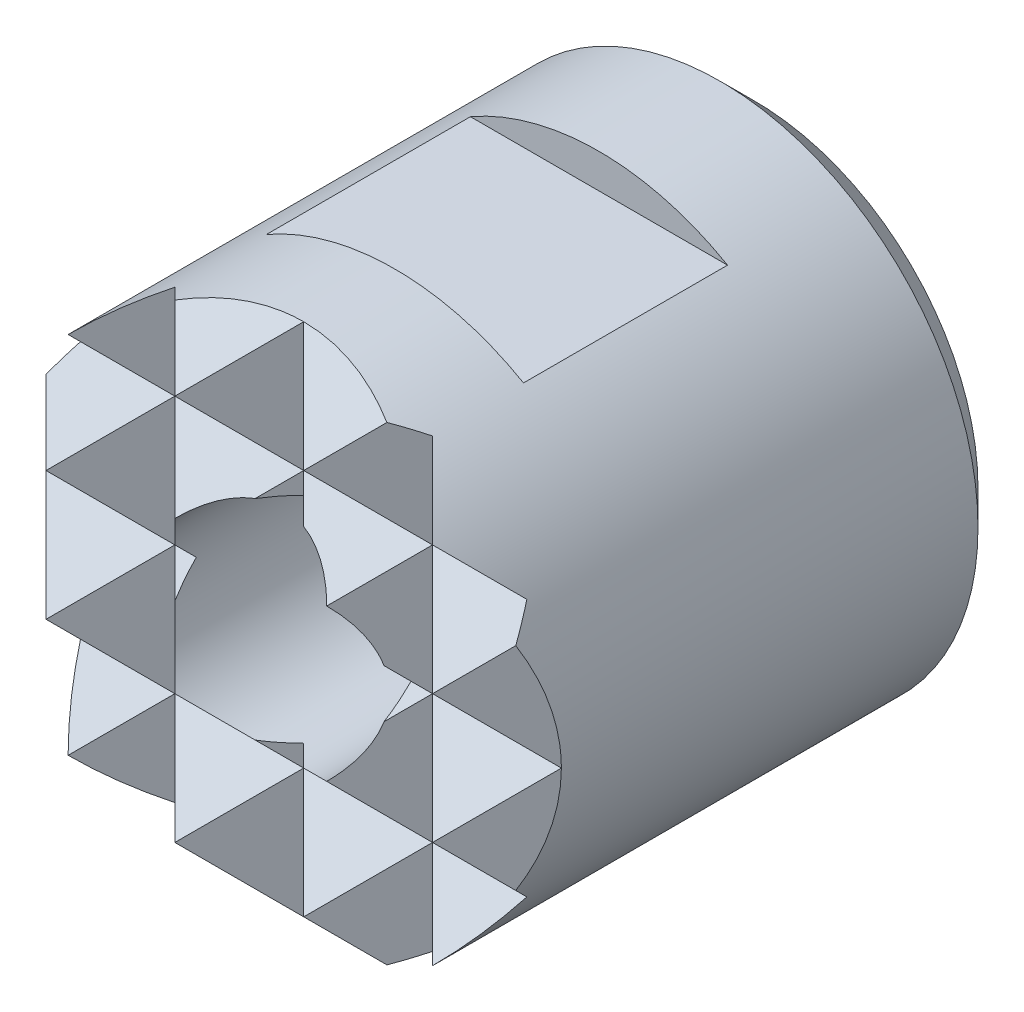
ISO-10303-21;
HEADER;
FILE_DESCRIPTION(('STEP AP214'),'2;1');
FILE_NAME('part.step','',(''),(''),'','','');
FILE_SCHEMA(('AUTOMOTIVE_DESIGN { 1 0 10303 214 1 1 1 1 }'));
ENDSEC;
DATA;
#1=APPLICATION_CONTEXT('core data for automotive mechanical design processes');
#2=APPLICATION_PROTOCOL_DEFINITION('international standard','automotive_design',2000,#1);
#3=PRODUCT_CONTEXT('',#1,'mechanical');
#4=PRODUCT('Part','Part','',(#3));
#5=PRODUCT_RELATED_PRODUCT_CATEGORY('part','',(#4));
#6=PRODUCT_DEFINITION_FORMATION('','',#4);
#7=PRODUCT_DEFINITION_CONTEXT('part definition',#1,'design');
#8=PRODUCT_DEFINITION('design','',#6,#7);
#9=PRODUCT_DEFINITION_SHAPE('','',#8);
#10=(LENGTH_UNIT() NAMED_UNIT(*) SI_UNIT(.MILLI.,.METRE.));
#11=(NAMED_UNIT(*) PLANE_ANGLE_UNIT() SI_UNIT($,.RADIAN.));
#12=(NAMED_UNIT(*) SI_UNIT($,.STERADIAN.) SOLID_ANGLE_UNIT());
#13=UNCERTAINTY_MEASURE_WITH_UNIT(LENGTH_MEASURE(1.E-05),#10,'distance_accuracy_value','');
#14=(GEOMETRIC_REPRESENTATION_CONTEXT(3) GLOBAL_UNCERTAINTY_ASSIGNED_CONTEXT((#13)) GLOBAL_UNIT_ASSIGNED_CONTEXT((#10,
#11,#12)) REPRESENTATION_CONTEXT('',''));
#15=CARTESIAN_POINT('',(0.,0.,0.));
#16=DIRECTION('',(0.,0.,1.));
#17=DIRECTION('',(1.,0.,0.));
#18=AXIS2_PLACEMENT_3D('',#15,#16,#17);
#19=CARTESIAN_POINT('',(-10.,-3.,10.5));
#20=DIRECTION('',(0.,-0.707106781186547,-0.707106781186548));
#21=DIRECTION('',(0.,0.707106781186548,-0.707106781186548));
#22=AXIS2_PLACEMENT_3D('',#19,#20,#21);
#23=PLANE('',#22);
#24=DIRECTION('',(1.,0.,0.));
#25=VECTOR('',#24,1.);
#26=CARTESIAN_POINT('',(-10.,-3.,10.5));
#27=LINE('',#26,#25);
#28=CARTESIAN_POINT('',(3.,-3.,10.5));
#29=VERTEX_POINT('',#28);
#30=CARTESIAN_POINT('',(5.19615242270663,-3.,10.5));
#31=VERTEX_POINT('',#30);
#32=EDGE_CURVE('E280',#29,#31,#27,.T.);
#33=ORIENTED_EDGE('',*,*,#32,.F.);
#34=DIRECTION('',(0.577350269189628,-0.577350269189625,0.577350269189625));
#35=VECTOR('',#34,1.);
#36=CARTESIAN_POINT('',(-1.33333333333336,1.33333333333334,6.16666666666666));
#37=LINE('',#36,#35);
#38=CARTESIAN_POINT('',(4.24264068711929,-4.24264068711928,11.7426406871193));
#39=VERTEX_POINT('',#38);
#40=EDGE_CURVE('E395',#29,#39,#37,.T.);
#41=ORIENTED_EDGE('',*,*,#40,.T.);
#42=CARTESIAN_POINT('',(0.,0.,7.5));
#43=DIRECTION('',(0.,-0.707106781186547,-0.707106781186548));
#44=DIRECTION('',(0.,0.707106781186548,-0.707106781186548));
#45=AXIS2_PLACEMENT_3D('',#42,#43,#44);
#46=ELLIPSE('',#45,8.48528137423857,6.);
#47=EDGE_CURVE('E341',#31,#39,#46,.T.);
#48=ORIENTED_EDGE('',*,*,#47,.F.);
#49=EDGE_LOOP('',(#33,#41,#48));
#50=FACE_BOUND('',#49,.T.);
#51=ADVANCED_FACE('F15',(#50),#23,.F.);
#52=DIRECTION('',(0.577350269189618,-0.57735026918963,0.57735026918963));
#53=VECTOR('',#52,1.);
#54=CARTESIAN_POINT('',(-3.33333333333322,0.333333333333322,7.16666666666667));
#55=LINE('',#54,#53);
#56=CARTESIAN_POINT('',(0.,-3.,10.5));
#57=VERTEX_POINT('',#56);
#58=CARTESIAN_POINT('',(1.5,-4.5,12.));
#59=VERTEX_POINT('',#58);
#60=EDGE_CURVE('E451',#57,#59,#55,.T.);
#61=ORIENTED_EDGE('',*,*,#60,.T.);
#62=DIRECTION('',(0.577350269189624,0.577350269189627,-0.577350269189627));
#63=VECTOR('',#62,1.);
#64=CARTESIAN_POINT('',(-1.33333333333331,-7.33333333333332,14.8333333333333));
#65=LINE('',#64,#63);
#66=EDGE_CURVE('E38',#59,#29,#65,.T.);
#67=ORIENTED_EDGE('',*,*,#66,.T.);
#68=EDGE_CURVE('E370',#57,#29,#27,.T.);
#69=ORIENTED_EDGE('',*,*,#68,.F.);
#70=EDGE_LOOP('',(#61,#67,#69));
#71=FACE_BOUND('',#70,.T.);
#72=ADVANCED_FACE('F502',(#71),#23,.F.);
#73=DIRECTION('',(0.577350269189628,-0.577350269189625,0.577350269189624));
#74=VECTOR('',#73,1.);
#75=CARTESIAN_POINT('',(-5.33333333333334,-0.666666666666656,8.16666666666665));
#76=LINE('',#75,#74);
#77=CARTESIAN_POINT('',(-2.99999999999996,-3.,10.5));
#78=VERTEX_POINT('',#77);
#79=CARTESIAN_POINT('',(-1.49999999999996,-4.5,12.));
#80=VERTEX_POINT('',#79);
#81=EDGE_CURVE('E230',#78,#80,#76,.T.);
#82=ORIENTED_EDGE('',*,*,#81,.T.);
#83=DIRECTION('',(0.577350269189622,0.577350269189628,-0.577350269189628));
#84=VECTOR('',#83,1.);
#85=CARTESIAN_POINT('',(-3.33333333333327,-6.33333333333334,13.8333333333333));
#86=LINE('',#85,#84);
#87=EDGE_CURVE('E30',#80,#57,#86,.T.);
#88=ORIENTED_EDGE('',*,*,#87,.T.);
#89=EDGE_CURVE('E279',#78,#57,#27,.T.);
#90=ORIENTED_EDGE('',*,*,#89,.F.);
#91=EDGE_LOOP('',(#82,#88,#90));
#92=FACE_BOUND('',#91,.T.);
#93=ADVANCED_FACE('F377',(#92),#23,.F.);
#94=CARTESIAN_POINT('',(-10.,-4.5,12.));
#95=DIRECTION('',(0.,0.707106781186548,-0.707106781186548));
#96=DIRECTION('',(0.,0.707106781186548,0.707106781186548));
#97=AXIS2_PLACEMENT_3D('',#94,#95,#96);
#98=PLANE('',#97);
#99=DIRECTION('',(-0.577350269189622,0.577350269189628,0.577350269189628));
#100=VECTOR('',#99,1.);
#101=CARTESIAN_POINT('',(-4.33333333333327,-1.66666666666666,14.8333333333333));
#102=LINE('',#101,#100);
#103=CARTESIAN_POINT('',(0.,-6.,10.5));
#104=VERTEX_POINT('',#103);
#105=EDGE_CURVE('E469',#104,#80,#102,.T.);
#106=ORIENTED_EDGE('',*,*,#105,.T.);
#107=DIRECTION('',(-0.577350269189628,-0.577350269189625,-0.577350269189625));
#108=VECTOR('',#107,1.);
#109=CARTESIAN_POINT('',(-4.33333333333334,-7.33333333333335,9.16666666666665));
#110=LINE('',#109,#108);
#111=CARTESIAN_POINT('',(-2.46862696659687,-5.4686269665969,11.0313730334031));
#112=VERTEX_POINT('',#111);
#113=EDGE_CURVE('E249',#80,#112,#110,.T.);
#114=ORIENTED_EDGE('',*,*,#113,.T.);
#115=CARTESIAN_POINT('',(0.,0.,16.5));
#116=DIRECTION('',(0.,0.707106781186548,-0.707106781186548));
#117=DIRECTION('',(0.,-0.707106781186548,-0.707106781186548));
#118=AXIS2_PLACEMENT_3D('',#115,#116,#117);
#119=ELLIPSE('',#118,8.48528137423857,6.);
#120=EDGE_CURVE('E241',#104,#112,#119,.T.);
#121=ORIENTED_EDGE('',*,*,#120,.F.);
#122=EDGE_LOOP('',(#106,#114,#121));
#123=FACE_BOUND('',#122,.T.);
#124=ADVANCED_FACE('F487',(#123),#98,.F.);
#125=CARTESIAN_POINT('',(-10.,6.,10.5));
#126=DIRECTION('',(0.,-0.707106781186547,-0.707106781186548));
#127=DIRECTION('',(0.,0.707106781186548,-0.707106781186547));
#128=AXIS2_PLACEMENT_3D('',#125,#126,#127);
#129=PLANE('',#128);
#130=CARTESIAN_POINT('',(0.,0.,16.5));
#131=DIRECTION('',(0.,-0.707106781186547,-0.707106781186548));
#132=DIRECTION('',(0.,0.707106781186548,-0.707106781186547));
#133=AXIS2_PLACEMENT_3D('',#130,#131,#132);
#134=ELLIPSE('',#133,8.48528137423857,6.);
#135=CARTESIAN_POINT('',(-2.46862696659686,5.4686269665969,11.0313730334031));
#136=VERTEX_POINT('',#135);
#137=CARTESIAN_POINT('',(0.,6.,10.5));
#138=VERTEX_POINT('',#137);
#139=EDGE_CURVE('E340',#136,#138,#134,.T.);
#140=ORIENTED_EDGE('',*,*,#139,.F.);
#141=DIRECTION('',(0.577350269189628,-0.577350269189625,0.577350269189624));
#142=VECTOR('',#141,1.);
#143=CARTESIAN_POINT('',(-5.33333333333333,8.33333333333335,8.16666666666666));
#144=LINE('',#143,#142);
#145=CARTESIAN_POINT('',(-1.49999999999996,4.5,12.));
#146=VERTEX_POINT('',#145);
#147=EDGE_CURVE('E255',#136,#146,#144,.T.);
#148=ORIENTED_EDGE('',*,*,#147,.T.);
#149=DIRECTION('',(0.577350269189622,0.577350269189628,-0.577350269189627));
#150=VECTOR('',#149,1.);
#151=CARTESIAN_POINT('',(-3.33333333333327,2.66666666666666,13.8333333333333));
#152=LINE('',#151,#150);
#153=EDGE_CURVE('E478',#146,#138,#152,.T.);
#154=ORIENTED_EDGE('',*,*,#153,.T.);
#155=EDGE_LOOP('',(#140,#148,#154));
#156=FACE_BOUND('',#155,.T.);
#157=ADVANCED_FACE('F525',(#156),#129,.F.);
#158=CARTESIAN_POINT('',(-10.,4.5,12.));
#159=DIRECTION('',(0.,0.707106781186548,-0.707106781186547));
#160=DIRECTION('',(0.,0.707106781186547,0.707106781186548));
#161=AXIS2_PLACEMENT_3D('',#158,#159,#160);
#162=PLANE('',#161);
#163=CARTESIAN_POINT('',(0.,0.,7.5));
#164=DIRECTION('',(0.,0.707106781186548,-0.707106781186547));
#165=DIRECTION('',(0.,-0.707106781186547,-0.707106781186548));
#166=AXIS2_PLACEMENT_3D('',#163,#164,#165);
#167=ELLIPSE('',#166,8.48528137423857,6.);
#168=CARTESIAN_POINT('',(4.24264068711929,4.24264068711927,11.7426406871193));
#169=VERTEX_POINT('',#168);
#170=CARTESIAN_POINT('',(5.19615242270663,3.,10.5));
#171=VERTEX_POINT('',#170);
#172=EDGE_CURVE('E335',#169,#171,#167,.T.);
#173=ORIENTED_EDGE('',*,*,#172,.F.);
#174=DIRECTION('',(-0.577350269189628,-0.577350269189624,-0.577350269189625));
#175=VECTOR('',#174,1.);
#176=CARTESIAN_POINT('',(-0.333333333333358,-0.333333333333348,7.16666666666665));
#177=LINE('',#176,#175);
#178=CARTESIAN_POINT('',(3.,3.,10.5));
#179=VERTEX_POINT('',#178);
#180=EDGE_CURVE('E420',#169,#179,#177,.T.);
#181=ORIENTED_EDGE('',*,*,#180,.T.);
#182=DIRECTION('',(1.,0.,0.));
#183=VECTOR('',#182,1.);
#184=CARTESIAN_POINT('',(-10.,3.,10.5));
#185=LINE('',#184,#183);
#186=EDGE_CURVE('E254',#179,#171,#185,.T.);
#187=ORIENTED_EDGE('',*,*,#186,.T.);
#188=EDGE_LOOP('',(#173,#181,#187));
#189=FACE_BOUND('',#188,.T.);
#190=ADVANCED_FACE('F530',(#189),#162,.F.);
#191=CARTESIAN_POINT('',(0.,3.,10.5));
#192=VERTEX_POINT('',#191);
#193=EDGE_CURVE('E260',#192,#179,#185,.T.);
#194=ORIENTED_EDGE('',*,*,#193,.T.);
#195=DIRECTION('',(-0.577350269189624,0.577350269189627,0.577350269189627));
#196=VECTOR('',#195,1.);
#197=CARTESIAN_POINT('',(-2.33333333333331,8.33333333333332,15.8333333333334));
#198=LINE('',#197,#196);
#199=CARTESIAN_POINT('',(1.5,4.5,12.));
#200=VERTEX_POINT('',#199);
#201=EDGE_CURVE('E445',#179,#200,#198,.T.);
#202=ORIENTED_EDGE('',*,*,#201,.T.);
#203=DIRECTION('',(-0.577350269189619,-0.577350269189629,-0.57735026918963));
#204=VECTOR('',#203,1.);
#205=CARTESIAN_POINT('',(-2.33333333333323,0.666666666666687,8.16666666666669));
#206=LINE('',#205,#204);
#207=EDGE_CURVE('E462',#200,#192,#206,.T.);
#208=ORIENTED_EDGE('',*,*,#207,.T.);
#209=EDGE_LOOP('',(#194,#202,#208));
#210=FACE_BOUND('',#209,.T.);
#211=ADVANCED_FACE('F911',(#210),#162,.F.);
#212=CARTESIAN_POINT('',(-2.99999999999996,3.,10.5));
#213=VERTEX_POINT('',#212);
#214=EDGE_CURVE('E283',#213,#192,#185,.T.);
#215=ORIENTED_EDGE('',*,*,#214,.T.);
#216=DIRECTION('',(-0.577350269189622,0.577350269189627,0.577350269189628));
#217=VECTOR('',#216,1.);
#218=CARTESIAN_POINT('',(-4.33333333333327,7.33333333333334,14.8333333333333));
#219=LINE('',#218,#217);
#220=EDGE_CURVE('E476',#192,#146,#219,.T.);
#221=ORIENTED_EDGE('',*,*,#220,.T.);
#222=DIRECTION('',(-0.577350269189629,-0.577350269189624,-0.577350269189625));
#223=VECTOR('',#222,1.);
#224=CARTESIAN_POINT('',(-4.33333333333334,1.66666666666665,9.16666666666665));
#225=LINE('',#224,#223);
#226=EDGE_CURVE('E247',#146,#213,#225,.T.);
#227=ORIENTED_EDGE('',*,*,#226,.T.);
#228=EDGE_LOOP('',(#215,#221,#227));
#229=FACE_BOUND('',#228,.T.);
#230=ADVANCED_FACE('F531',(#229),#162,.F.);
#231=CARTESIAN_POINT('',(-10.,3.,10.5));
#232=DIRECTION('',(0.,-0.707106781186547,-0.707106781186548));
#233=DIRECTION('',(0.,0.707106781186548,-0.707106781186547));
#234=AXIS2_PLACEMENT_3D('',#231,#232,#233);
#235=PLANE('',#234);
#236=CARTESIAN_POINT('',(0.,0.,13.5));
#237=DIRECTION('',(0.,-0.707106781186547,-0.707106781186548));
#238=DIRECTION('',(0.,-0.707106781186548,0.707106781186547));
#239=AXIS2_PLACEMENT_3D('',#236,#237,#238);
#240=ELLIPSE('',#239,3.53553390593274,2.5);
#241=CARTESIAN_POINT('',(-1.76776695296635,1.76776695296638,11.7322330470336));
#242=VERTEX_POINT('',#241);
#243=CARTESIAN_POINT('',(-0.564585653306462,2.43541434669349,11.0645856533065));
#244=VERTEX_POINT('',#243);
#245=EDGE_CURVE('E334',#242,#244,#240,.T.);
#246=ORIENTED_EDGE('',*,*,#245,.T.);
#247=DIRECTION('',(0.577350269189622,0.577350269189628,-0.577350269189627));
#248=VECTOR('',#247,1.);
#249=CARTESIAN_POINT('',(-3.33333333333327,-0.333333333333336,13.8333333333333));
#250=LINE('',#249,#248);
#251=EDGE_CURVE('E473',#244,#192,#250,.T.);
#252=ORIENTED_EDGE('',*,*,#251,.T.);
#253=ORIENTED_EDGE('',*,*,#214,.F.);
#254=DIRECTION('',(0.577350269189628,-0.577350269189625,0.577350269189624));
#255=VECTOR('',#254,1.);
#256=CARTESIAN_POINT('',(-5.33333333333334,5.33333333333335,8.16666666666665));
#257=LINE('',#256,#255);
#258=EDGE_CURVE('E242',#213,#242,#257,.T.);
#259=ORIENTED_EDGE('',*,*,#258,.T.);
#260=EDGE_LOOP('',(#246,#252,#253,#259));
#261=FACE_BOUND('',#260,.T.);
#262=ADVANCED_FACE('F535',(#261),#235,.F.);
#263=ORIENTED_EDGE('',*,*,#193,.F.);
#264=DIRECTION('',(0.577350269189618,-0.57735026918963,0.577350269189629));
#265=VECTOR('',#264,1.);
#266=CARTESIAN_POINT('',(-3.33333333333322,6.33333333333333,7.16666666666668));
#267=LINE('',#266,#265);
#268=CARTESIAN_POINT('',(0.564585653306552,2.43541434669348,11.0645856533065));
#269=VERTEX_POINT('',#268);
#270=EDGE_CURVE('E459',#192,#269,#267,.T.);
#271=ORIENTED_EDGE('',*,*,#270,.T.);
#272=CARTESIAN_POINT('',(1.76776695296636,1.76776695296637,11.7322330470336));
#273=VERTEX_POINT('',#272);
#274=EDGE_CURVE('E331',#269,#273,#240,.T.);
#275=ORIENTED_EDGE('',*,*,#274,.T.);
#276=DIRECTION('',(0.577350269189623,0.577350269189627,-0.577350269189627));
#277=VECTOR('',#276,1.);
#278=CARTESIAN_POINT('',(-1.33333333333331,-1.33333333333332,14.8333333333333));
#279=LINE('',#278,#277);
#280=EDGE_CURVE('E441',#273,#179,#279,.T.);
#281=ORIENTED_EDGE('',*,*,#280,.T.);
#282=EDGE_LOOP('',(#263,#271,#275,#281));
#283=FACE_BOUND('',#282,.T.);
#284=ADVANCED_FACE('F933',(#283),#235,.F.);
#285=ORIENTED_EDGE('',*,*,#186,.F.);
#286=DIRECTION('',(0.577350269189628,-0.577350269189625,0.577350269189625));
#287=VECTOR('',#286,1.);
#288=CARTESIAN_POINT('',(-1.33333333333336,7.33333333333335,6.16666666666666));
#289=LINE('',#288,#287);
#290=CARTESIAN_POINT('',(4.5,1.49999999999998,12.));
#291=VERTEX_POINT('',#290);
#292=EDGE_CURVE('E417',#179,#291,#289,.T.);
#293=ORIENTED_EDGE('',*,*,#292,.T.);
#294=DIRECTION('',(0.577350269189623,0.577350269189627,-0.577350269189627));
#295=VECTOR('',#294,1.);
#296=CARTESIAN_POINT('',(0.666666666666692,-2.33333333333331,15.8333333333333));
#297=LINE('',#296,#295);
#298=CARTESIAN_POINT('',(5.46862696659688,2.4686269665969,11.0313730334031));
#299=VERTEX_POINT('',#298);
#300=EDGE_CURVE('E411',#291,#299,#297,.T.);
#301=ORIENTED_EDGE('',*,*,#300,.T.);
#302=CARTESIAN_POINT('',(0.,0.,13.5));
#303=DIRECTION('',(0.,-0.707106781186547,-0.707106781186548));
#304=DIRECTION('',(0.,0.707106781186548,-0.707106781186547));
#305=AXIS2_PLACEMENT_3D('',#302,#303,#304);
#306=ELLIPSE('',#305,8.48528137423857,6.);
#307=EDGE_CURVE('E289',#171,#299,#306,.T.);
#308=ORIENTED_EDGE('',*,*,#307,.F.);
#309=EDGE_LOOP('',(#285,#293,#301,#308));
#310=FACE_BOUND('',#309,.T.);
#311=ADVANCED_FACE('F536',(#310),#235,.F.);
#312=CARTESIAN_POINT('',(-10.,1.5,12.));
#313=DIRECTION('',(0.,0.707106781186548,-0.707106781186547));
#314=DIRECTION('',(0.,0.707106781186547,0.707106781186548));
#315=AXIS2_PLACEMENT_3D('',#312,#313,#314);
#316=PLANE('',#315);
#317=CARTESIAN_POINT('',(0.,0.,10.5));
#318=DIRECTION('',(0.,0.707106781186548,-0.707106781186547));
#319=DIRECTION('',(0.,0.707106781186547,0.707106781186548));
#320=AXIS2_PLACEMENT_3D('',#317,#318,#319);
#321=ELLIPSE('',#320,3.53553390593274,2.5);
#322=CARTESIAN_POINT('',(-2.5,0.,10.5));
#323=VERTEX_POINT('',#322);
#324=CARTESIAN_POINT('',(-2.43541434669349,0.564585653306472,11.0645856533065));
#325=VERTEX_POINT('',#324);
#326=EDGE_CURVE('E327',#323,#325,#321,.T.);
#327=ORIENTED_EDGE('',*,*,#326,.T.);
#328=DIRECTION('',(-0.577350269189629,-0.577350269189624,-0.577350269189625));
#329=VECTOR('',#328,1.);
#330=CARTESIAN_POINT('',(-4.33333333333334,-1.33333333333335,9.16666666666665));
#331=LINE('',#330,#329);
#332=CARTESIAN_POINT('',(-2.99999999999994,0.,10.5));
#333=VERTEX_POINT('',#332);
#334=EDGE_CURVE('E484',#325,#333,#331,.T.);
#335=ORIENTED_EDGE('',*,*,#334,.T.);
#336=DIRECTION('',(1.,0.,0.));
#337=VECTOR('',#336,1.);
#338=CARTESIAN_POINT('',(-10.,0.,10.5));
#339=LINE('',#338,#337);
#340=EDGE_CURVE('E274',#333,#323,#339,.T.);
#341=ORIENTED_EDGE('',*,*,#340,.T.);
#342=EDGE_LOOP('',(#327,#335,#341));
#343=FACE_BOUND('',#342,.T.);
#344=ADVANCED_FACE('F728',(#343),#316,.F.);
#345=CARTESIAN_POINT('',(2.5,0.,10.5));
#346=VERTEX_POINT('',#345);
#347=CARTESIAN_POINT('',(3.,0.,10.5));
#348=VERTEX_POINT('',#347);
#349=EDGE_CURVE('E271',#346,#348,#339,.T.);
#350=ORIENTED_EDGE('',*,*,#349,.T.);
#351=DIRECTION('',(-0.577350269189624,0.577350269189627,0.577350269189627));
#352=VECTOR('',#351,1.);
#353=CARTESIAN_POINT('',(-2.33333333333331,5.33333333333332,15.8333333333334));
#354=LINE('',#353,#352);
#355=CARTESIAN_POINT('',(2.43541434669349,0.564585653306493,11.0645856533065));
#356=VERTEX_POINT('',#355);
#357=EDGE_CURVE('E433',#348,#356,#354,.T.);
#358=ORIENTED_EDGE('',*,*,#357,.T.);
#359=EDGE_CURVE('E330',#356,#346,#321,.T.);
#360=ORIENTED_EDGE('',*,*,#359,.T.);
#361=EDGE_LOOP('',(#350,#358,#360));
#362=FACE_BOUND('',#361,.T.);
#363=ADVANCED_FACE('F745',(#362),#316,.F.);
#364=CARTESIAN_POINT('',(-10.,0.,10.5));
#365=DIRECTION('',(0.,-0.707106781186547,-0.707106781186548));
#366=DIRECTION('',(0.,0.707106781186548,-0.707106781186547));
#367=AXIS2_PLACEMENT_3D('',#364,#365,#366);
#368=PLANE('',#367);
#369=CARTESIAN_POINT('',(0.,0.,10.5));
#370=DIRECTION('',(0.,-0.707106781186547,-0.707106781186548));
#371=DIRECTION('',(0.,-0.707106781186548,0.707106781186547));
#372=AXIS2_PLACEMENT_3D('',#369,#370,#371);
#373=ELLIPSE('',#372,3.53553390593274,2.5);
#374=CARTESIAN_POINT('',(2.43541434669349,-0.564585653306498,11.0645856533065));
#375=VERTEX_POINT('',#374);
#376=EDGE_CURVE('E323',#346,#375,#373,.T.);
#377=ORIENTED_EDGE('',*,*,#376,.T.);
#378=DIRECTION('',(0.577350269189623,0.577350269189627,-0.577350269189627));
#379=VECTOR('',#378,1.);
#380=CARTESIAN_POINT('',(-1.33333333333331,-4.33333333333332,14.8333333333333));
#381=LINE('',#380,#379);
#382=EDGE_CURVE('E429',#375,#348,#381,.T.);
#383=ORIENTED_EDGE('',*,*,#382,.T.);
#384=ORIENTED_EDGE('',*,*,#349,.F.);
#385=EDGE_LOOP('',(#377,#383,#384));
#386=FACE_BOUND('',#385,.T.);
#387=ADVANCED_FACE('F737',(#386),#368,.F.);
#388=ORIENTED_EDGE('',*,*,#340,.F.);
#389=DIRECTION('',(0.577350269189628,-0.577350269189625,0.577350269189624));
#390=VECTOR('',#389,1.);
#391=CARTESIAN_POINT('',(-5.33333333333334,2.33333333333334,8.16666666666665));
#392=LINE('',#391,#390);
#393=CARTESIAN_POINT('',(-2.43541434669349,-0.56458565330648,11.0645856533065));
#394=VERTEX_POINT('',#393);
#395=EDGE_CURVE('E481',#333,#394,#392,.T.);
#396=ORIENTED_EDGE('',*,*,#395,.T.);
#397=EDGE_CURVE('E326',#394,#323,#373,.T.);
#398=ORIENTED_EDGE('',*,*,#397,.T.);
#399=EDGE_LOOP('',(#388,#396,#398));
#400=FACE_BOUND('',#399,.T.);
#401=ADVANCED_FACE('F719',(#400),#368,.F.);
#402=CARTESIAN_POINT('',(-10.,-1.5,12.));
#403=DIRECTION('',(0.,0.707106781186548,-0.707106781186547));
#404=DIRECTION('',(0.,0.707106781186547,0.707106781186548));
#405=AXIS2_PLACEMENT_3D('',#402,#403,#404);
#406=PLANE('',#405);
#407=ORIENTED_EDGE('',*,*,#89,.T.);
#408=DIRECTION('',(-0.577350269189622,0.577350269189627,0.577350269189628));
#409=VECTOR('',#408,1.);
#410=CARTESIAN_POINT('',(-4.33333333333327,1.33333333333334,14.8333333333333));
#411=LINE('',#410,#409);
#412=CARTESIAN_POINT('',(-0.564585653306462,-2.43541434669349,11.0645856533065));
#413=VERTEX_POINT('',#412);
#414=EDGE_CURVE('E9',#57,#413,#411,.T.);
#415=ORIENTED_EDGE('',*,*,#414,.T.);
#416=CARTESIAN_POINT('',(0.,0.,13.5));
#417=DIRECTION('',(0.,0.707106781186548,-0.707106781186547));
#418=DIRECTION('',(0.,0.707106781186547,0.707106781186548));
#419=AXIS2_PLACEMENT_3D('',#416,#417,#418);
#420=ELLIPSE('',#419,3.53553390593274,2.5);
#421=CARTESIAN_POINT('',(-1.76776695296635,-1.76776695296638,11.7322330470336));
#422=VERTEX_POINT('',#421);
#423=EDGE_CURVE('E319',#413,#422,#420,.T.);
#424=ORIENTED_EDGE('',*,*,#423,.T.);
#425=DIRECTION('',(-0.577350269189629,-0.577350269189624,-0.577350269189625));
#426=VECTOR('',#425,1.);
#427=CARTESIAN_POINT('',(-4.33333333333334,-4.33333333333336,9.16666666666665));
#428=LINE('',#427,#426);
#429=EDGE_CURVE('E353',#422,#78,#428,.T.);
#430=ORIENTED_EDGE('',*,*,#429,.T.);
#431=EDGE_LOOP('',(#407,#415,#424,#430));
#432=FACE_BOUND('',#431,.T.);
#433=ADVANCED_FACE('F382',(#432),#406,.F.);
#434=CARTESIAN_POINT('',(1.76776695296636,-1.76776695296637,11.7322330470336));
#435=VERTEX_POINT('',#434);
#436=CARTESIAN_POINT('',(0.56458565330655,-2.43541434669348,11.0645856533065));
#437=VERTEX_POINT('',#436);
#438=EDGE_CURVE('E322',#435,#437,#420,.T.);
#439=ORIENTED_EDGE('',*,*,#438,.T.);
#440=DIRECTION('',(-0.577350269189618,-0.577350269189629,-0.57735026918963));
#441=VECTOR('',#440,1.);
#442=CARTESIAN_POINT('',(-2.33333333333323,-5.33333333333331,8.16666666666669));
#443=LINE('',#442,#441);
#444=EDGE_CURVE('E23',#437,#57,#443,.T.);
#445=ORIENTED_EDGE('',*,*,#444,.T.);
#446=ORIENTED_EDGE('',*,*,#68,.T.);
#447=DIRECTION('',(-0.577350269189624,0.577350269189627,0.577350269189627));
#448=VECTOR('',#447,1.);
#449=CARTESIAN_POINT('',(-2.33333333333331,2.33333333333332,15.8333333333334));
#450=LINE('',#449,#448);
#451=EDGE_CURVE('E362',#29,#435,#450,.T.);
#452=ORIENTED_EDGE('',*,*,#451,.T.);
#453=EDGE_LOOP('',(#439,#445,#446,#452));
#454=FACE_BOUND('',#453,.T.);
#455=ADVANCED_FACE('F368',(#454),#406,.F.);
#456=DIRECTION('',(-0.577350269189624,0.577350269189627,0.577350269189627));
#457=VECTOR('',#456,1.);
#458=CARTESIAN_POINT('',(-0.333333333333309,3.33333333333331,16.8333333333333));
#459=LINE('',#458,#457);
#460=CARTESIAN_POINT('',(5.46862696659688,-2.4686269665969,11.0313730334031));
#461=VERTEX_POINT('',#460);
#462=CARTESIAN_POINT('',(4.5,-1.5,12.));
#463=VERTEX_POINT('',#462);
#464=EDGE_CURVE('E356',#461,#463,#459,.T.);
#465=ORIENTED_EDGE('',*,*,#464,.T.);
#466=DIRECTION('',(-0.577350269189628,-0.577350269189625,-0.577350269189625));
#467=VECTOR('',#466,1.);
#468=CARTESIAN_POINT('',(-0.333333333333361,-6.33333333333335,7.16666666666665));
#469=LINE('',#468,#467);
#470=EDGE_CURVE('E359',#463,#29,#469,.T.);
#471=ORIENTED_EDGE('',*,*,#470,.T.);
#472=ORIENTED_EDGE('',*,*,#32,.T.);
#473=CARTESIAN_POINT('',(0.,0.,13.5));
#474=DIRECTION('',(0.,0.707106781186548,-0.707106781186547));
#475=DIRECTION('',(0.,-0.707106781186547,-0.707106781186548));
#476=AXIS2_PLACEMENT_3D('',#473,#474,#475);
#477=ELLIPSE('',#476,8.48528137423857,6.);
#478=EDGE_CURVE('E284',#461,#31,#477,.T.);
#479=ORIENTED_EDGE('',*,*,#478,.F.);
#480=EDGE_LOOP('',(#465,#471,#472,#479));
#481=FACE_BOUND('',#480,.T.);
#482=ADVANCED_FACE('F390',(#481),#406,.F.);
#483=CARTESIAN_POINT('',(0.,0.,12.));
#484=DIRECTION('',(0.,0.,-1.));
#485=DIRECTION('',(-1.,0.,0.));
#486=AXIS2_PLACEMENT_3D('',#483,#484,#485);
#487=CYLINDRICAL_SURFACE('',#486,6.);
#488=CARTESIAN_POINT('',(0.,0.,8.375));
#489=DIRECTION('',(0.,0.,1.));
#490=DIRECTION('',(1.,0.,0.));
#491=AXIS2_PLACEMENT_3D('',#488,#489,#490);
#492=CIRCLE('',#491,6.);
#493=CARTESIAN_POINT('',(2.99332590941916,5.2,8.375));
#494=VERTEX_POINT('',#493);
#495=CARTESIAN_POINT('',(-2.99332590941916,5.2,8.375));
#496=VERTEX_POINT('',#495);
#497=EDGE_CURVE('E313',#494,#496,#492,.T.);
#498=ORIENTED_EDGE('',*,*,#497,.T.);
#499=DIRECTION('',(0.,0.,-1.));
#500=VECTOR('',#499,1.);
#501=CARTESIAN_POINT('',(-2.99332590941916,5.2,12.));
#502=LINE('',#501,#500);
#503=CARTESIAN_POINT('',(-2.99332590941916,5.2,3.625));
#504=VERTEX_POINT('',#503);
#505=EDGE_CURVE('E316',#496,#504,#502,.T.);
#506=ORIENTED_EDGE('',*,*,#505,.T.);
#507=CARTESIAN_POINT('',(0.,0.,3.625));
#508=DIRECTION('',(0.,0.,-1.));
#509=DIRECTION('',(-1.,0.,0.));
#510=AXIS2_PLACEMENT_3D('',#507,#508,#509);
#511=CIRCLE('',#510,6.);
#512=CARTESIAN_POINT('',(2.99332590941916,5.2,3.625));
#513=VERTEX_POINT('',#512);
#514=EDGE_CURVE('E310',#504,#513,#511,.T.);
#515=ORIENTED_EDGE('',*,*,#514,.T.);
#516=DIRECTION('',(0.,0.,-1.));
#517=VECTOR('',#516,1.);
#518=CARTESIAN_POINT('',(2.99332590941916,5.2,12.));
#519=LINE('',#518,#517);
#520=EDGE_CURVE('E307',#513,#494,#519,.F.);
#521=ORIENTED_EDGE('',*,*,#520,.T.);
#522=EDGE_LOOP('',(#498,#506,#515,#521));
#523=FACE_BOUND('',#522,.T.);
#524=CARTESIAN_POINT('',(0.,0.,0.8));
#525=DIRECTION('',(0.,0.,1.));
#526=DIRECTION('',(1.,0.,0.));
#527=AXIS2_PLACEMENT_3D('',#524,#525,#526);
#528=CIRCLE('',#527,6.);
#529=CARTESIAN_POINT('',(6.,0.,0.8));
#530=VERTEX_POINT('',#529);
#531=EDGE_CURVE('E301',#530,#530,#528,.T.);
#532=ORIENTED_EDGE('',*,*,#531,.T.);
#533=EDGE_LOOP('',(#532));
#534=FACE_BOUND('',#533,.T.);
#535=CARTESIAN_POINT('',(2.46862696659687,5.46862696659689,11.0313730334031));
#536=VERTEX_POINT('',#535);
#537=EDGE_CURVE('E337',#138,#536,#134,.T.);
#538=ORIENTED_EDGE('',*,*,#537,.T.);
#539=CARTESIAN_POINT('',(0.,0.,13.5));
#540=DIRECTION('',(-0.70710678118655,0.,-0.707106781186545));
#541=DIRECTION('',(0.707106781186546,0.,-0.70710678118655));
#542=AXIS2_PLACEMENT_3D('',#539,#540,#541);
#543=ELLIPSE('',#542,8.4852813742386,6.);
#544=CARTESIAN_POINT('',(3.,5.19615242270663,10.5));
#545=VERTEX_POINT('',#544);
#546=EDGE_CURVE('E442',#536,#545,#543,.T.);
#547=ORIENTED_EDGE('',*,*,#546,.T.);
#548=CARTESIAN_POINT('',(0.,0.,7.5));
#549=DIRECTION('',(0.707106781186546,0.,-0.70710678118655));
#550=DIRECTION('',(-0.70710678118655,0.,-0.707106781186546));
#551=AXIS2_PLACEMENT_3D('',#548,#549,#550);
#552=ELLIPSE('',#551,8.48528137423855,6.);
#553=EDGE_CURVE('E425',#545,#169,#552,.T.);
#554=ORIENTED_EDGE('',*,*,#553,.T.);
#555=ORIENTED_EDGE('',*,*,#172,.T.);
#556=ORIENTED_EDGE('',*,*,#307,.T.);
#557=CARTESIAN_POINT('',(0.,0.,16.5));
#558=DIRECTION('',(-0.70710678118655,0.,-0.707106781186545));
#559=DIRECTION('',(0.707106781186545,0.,-0.70710678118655));
#560=AXIS2_PLACEMENT_3D('',#557,#558,#559);
#561=ELLIPSE('',#560,8.4852813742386,6.);
#562=CARTESIAN_POINT('',(6.,0.,10.5));
#563=VERTEX_POINT('',#562);
#564=EDGE_CURVE('E403',#299,#563,#561,.T.);
#565=ORIENTED_EDGE('',*,*,#564,.T.);
#566=EDGE_CURVE('E401',#563,#461,#561,.T.);
#567=ORIENTED_EDGE('',*,*,#566,.T.);
#568=ORIENTED_EDGE('',*,*,#478,.T.);
#569=ORIENTED_EDGE('',*,*,#47,.T.);
#570=CARTESIAN_POINT('',(3.,-5.19615242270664,10.5));
#571=VERTEX_POINT('',#570);
#572=EDGE_CURVE('E398',#39,#571,#552,.T.);
#573=ORIENTED_EDGE('',*,*,#572,.T.);
#574=CARTESIAN_POINT('',(2.46862696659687,-5.46862696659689,11.0313730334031));
#575=VERTEX_POINT('',#574);
#576=EDGE_CURVE('E439',#571,#575,#543,.T.);
#577=ORIENTED_EDGE('',*,*,#576,.T.);
#578=EDGE_CURVE('E346',#575,#104,#119,.T.);
#579=ORIENTED_EDGE('',*,*,#578,.T.);
#580=ORIENTED_EDGE('',*,*,#120,.T.);
#581=CARTESIAN_POINT('',(0.,0.,13.5));
#582=DIRECTION('',(0.707106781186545,0.,-0.70710678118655));
#583=DIRECTION('',(-0.70710678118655,0.,-0.707106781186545));
#584=AXIS2_PLACEMENT_3D('',#581,#582,#583);
#585=ELLIPSE('',#584,8.48528137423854,6.);
#586=CARTESIAN_POINT('',(-2.99999999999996,-5.19615242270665,10.5));
#587=VERTEX_POINT('',#586);
#588=EDGE_CURVE('E227',#112,#587,#585,.T.);
#589=ORIENTED_EDGE('',*,*,#588,.T.);
#590=CARTESIAN_POINT('',(0.,0.,7.5));
#591=DIRECTION('',(-0.70710678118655,0.,-0.707106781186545));
#592=DIRECTION('',(0.707106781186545,0.,-0.70710678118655));
#593=AXIS2_PLACEMENT_3D('',#590,#591,#592);
#594=ELLIPSE('',#593,8.4852813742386,6.);
#595=CARTESIAN_POINT('',(-4.24264068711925,-4.24264068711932,11.7426406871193));
#596=VERTEX_POINT('',#595);
#597=EDGE_CURVE('E213',#587,#596,#594,.T.);
#598=ORIENTED_EDGE('',*,*,#597,.T.);
#599=CARTESIAN_POINT('',(-5.19615242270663,-3.,10.5));
#600=VERTEX_POINT('',#599);
#601=EDGE_CURVE('E344',#596,#600,#46,.T.);
#602=ORIENTED_EDGE('',*,*,#601,.T.);
#603=CARTESIAN_POINT('',(-5.46862696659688,-2.46862696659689,11.0313730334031));
#604=VERTEX_POINT('',#603);
#605=EDGE_CURVE('E286',#600,#604,#477,.T.);
#606=ORIENTED_EDGE('',*,*,#605,.T.);
#607=CARTESIAN_POINT('',(0.,0.,16.5));
#608=DIRECTION('',(0.707106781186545,0.,-0.70710678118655));
#609=DIRECTION('',(-0.70710678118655,0.,-0.707106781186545));
#610=AXIS2_PLACEMENT_3D('',#607,#608,#609);
#611=ELLIPSE('',#610,8.48528137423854,6.);
#612=CARTESIAN_POINT('',(-6.,0.,10.5));
#613=VERTEX_POINT('',#612);
#614=EDGE_CURVE('E1128',#604,#613,#611,.T.);
#615=ORIENTED_EDGE('',*,*,#614,.T.);
#616=CARTESIAN_POINT('',(-5.46862696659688,2.4686269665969,11.0313730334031));
#617=VERTEX_POINT('',#616);
#618=EDGE_CURVE('E1131',#613,#617,#611,.T.);
#619=ORIENTED_EDGE('',*,*,#618,.T.);
#620=CARTESIAN_POINT('',(-5.19615242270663,3.,10.5));
#621=VERTEX_POINT('',#620);
#622=EDGE_CURVE('E287',#617,#621,#306,.T.);
#623=ORIENTED_EDGE('',*,*,#622,.T.);
#624=CARTESIAN_POINT('',(-4.24264068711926,4.24264068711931,11.7426406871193));
#625=VERTEX_POINT('',#624);
#626=EDGE_CURVE('E338',#621,#625,#167,.T.);
#627=ORIENTED_EDGE('',*,*,#626,.T.);
#628=CARTESIAN_POINT('',(-2.99999999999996,5.19615242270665,10.5));
#629=VERTEX_POINT('',#628);
#630=EDGE_CURVE('E223',#625,#629,#594,.T.);
#631=ORIENTED_EDGE('',*,*,#630,.T.);
#632=EDGE_CURVE('E245',#629,#136,#585,.T.);
#633=ORIENTED_EDGE('',*,*,#632,.T.);
#634=ORIENTED_EDGE('',*,*,#139,.T.);
#635=EDGE_LOOP('',(#538,#547,#554,#555,#556,#565,#567,#568,#569,#573,#577,#579,#580,#589,#598,
#602,#606,#615,#619,#623,#627,#631,#633,#634));
#636=FACE_BOUND('',#635,.T.);
#637=ADVANCED_FACE('F238',(#523,#534,#636),#487,.T.);
#638=CARTESIAN_POINT('',(0.,0.,0.));
#639=DIRECTION('',(0.,0.,1.));
#640=DIRECTION('',(1.,0.,0.));
#641=AXIS2_PLACEMENT_3D('',#638,#639,#640);
#642=PLANE('',#641);
#643=CARTESIAN_POINT('',(0.,0.,0.));
#644=DIRECTION('',(0.,0.,1.));
#645=DIRECTION('',(1.,0.,0.));
#646=AXIS2_PLACEMENT_3D('',#643,#644,#645);
#647=CIRCLE('',#646,5.2);
#648=CARTESIAN_POINT('',(5.2,0.,0.));
#649=VERTEX_POINT('',#648);
#650=EDGE_CURVE('E304',#649,#649,#647,.F.);
#651=ORIENTED_EDGE('',*,*,#650,.T.);
#652=EDGE_LOOP('',(#651));
#653=FACE_BOUND('',#652,.T.);
#654=CARTESIAN_POINT('',(0.,0.,0.));
#655=DIRECTION('',(0.,0.,1.));
#656=DIRECTION('',(1.,0.,0.));
#657=AXIS2_PLACEMENT_3D('',#654,#655,#656);
#658=CIRCLE('',#657,2.95);
#659=CARTESIAN_POINT('',(2.95,0.,0.));
#660=VERTEX_POINT('',#659);
#661=EDGE_CURVE('E293',#660,#660,#658,.T.);
#662=ORIENTED_EDGE('',*,*,#661,.T.);
#663=EDGE_LOOP('',(#662));
#664=FACE_BOUND('',#663,.T.);
#665=ADVANCED_FACE('F552',(#653,#664),#642,.F.);
#666=CARTESIAN_POINT('',(0.,0.,12.));
#667=DIRECTION('',(0.,0.,1.));
#668=DIRECTION('',(1.,0.,0.));
#669=AXIS2_PLACEMENT_3D('',#666,#667,#668);
#670=CYLINDRICAL_SURFACE('',#669,2.5);
#671=CARTESIAN_POINT('',(0.,0.,13.5));
#672=DIRECTION('',(0.707106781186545,0.,-0.70710678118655));
#673=DIRECTION('',(0.70710678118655,0.,0.707106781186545));
#674=AXIS2_PLACEMENT_3D('',#671,#672,#673);
#675=ELLIPSE('',#674,3.53553390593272,2.5);
#676=EDGE_CURVE('E251',#422,#394,#675,.T.);
#677=ORIENTED_EDGE('',*,*,#676,.F.);
#678=ORIENTED_EDGE('',*,*,#423,.F.);
#679=CARTESIAN_POINT('',(0.,0.,10.5));
#680=DIRECTION('',(-0.707106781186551,0.,-0.707106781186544));
#681=DIRECTION('',(-0.707106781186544,0.,0.707106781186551));
#682=AXIS2_PLACEMENT_3D('',#679,#680,#681);
#683=ELLIPSE('',#682,3.53553390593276,2.5);
#684=CARTESIAN_POINT('',(0.,-2.5,10.5));
#685=VERTEX_POINT('',#684);
#686=EDGE_CURVE('E378',#685,#413,#683,.T.);
#687=ORIENTED_EDGE('',*,*,#686,.F.);
#688=CARTESIAN_POINT('',(0.,0.,10.5));
#689=DIRECTION('',(0.707106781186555,0.,-0.707106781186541));
#690=DIRECTION('',(0.707106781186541,0.,0.707106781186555));
#691=AXIS2_PLACEMENT_3D('',#688,#689,#690);
#692=ELLIPSE('',#691,3.53553390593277,2.5);
#693=EDGE_CURVE('E454',#437,#685,#692,.T.);
#694=ORIENTED_EDGE('',*,*,#693,.F.);
#695=ORIENTED_EDGE('',*,*,#438,.F.);
#696=CARTESIAN_POINT('',(0.,0.,13.5));
#697=DIRECTION('',(-0.70710678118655,0.,-0.707106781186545));
#698=DIRECTION('',(-0.707106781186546,0.,0.70710678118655));
#699=AXIS2_PLACEMENT_3D('',#696,#697,#698);
#700=ELLIPSE('',#699,3.53553390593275,2.5);
#701=EDGE_CURVE('E427',#375,#435,#700,.T.);
#702=ORIENTED_EDGE('',*,*,#701,.F.);
#703=ORIENTED_EDGE('',*,*,#376,.F.);
#704=ORIENTED_EDGE('',*,*,#359,.F.);
#705=EDGE_CURVE('E430',#273,#356,#700,.T.);
#706=ORIENTED_EDGE('',*,*,#705,.F.);
#707=ORIENTED_EDGE('',*,*,#274,.F.);
#708=CARTESIAN_POINT('',(0.,2.5,10.5));
#709=VERTEX_POINT('',#708);
#710=EDGE_CURVE('E379',#709,#269,#692,.T.);
#711=ORIENTED_EDGE('',*,*,#710,.F.);
#712=EDGE_CURVE('E470',#244,#709,#683,.T.);
#713=ORIENTED_EDGE('',*,*,#712,.F.);
#714=ORIENTED_EDGE('',*,*,#245,.F.);
#715=EDGE_CURVE('E243',#325,#242,#675,.T.);
#716=ORIENTED_EDGE('',*,*,#715,.F.);
#717=ORIENTED_EDGE('',*,*,#326,.F.);
#718=ORIENTED_EDGE('',*,*,#397,.F.);
#719=EDGE_LOOP('',(#677,#678,#687,#694,#695,#702,#703,#704,#706,#707,#711,#713,#714,#716,#717,#718));
#720=FACE_BOUND('',#719,.T.);
#721=CARTESIAN_POINT('',(0.,0.,0.45));
#722=DIRECTION('',(0.,0.,1.));
#723=DIRECTION('',(1.,0.,0.));
#724=AXIS2_PLACEMENT_3D('',#721,#722,#723);
#725=CIRCLE('',#724,2.5);
#726=CARTESIAN_POINT('',(2.5,0.,0.45));
#727=VERTEX_POINT('',#726);
#728=EDGE_CURVE('E298',#727,#727,#725,.F.);
#729=ORIENTED_EDGE('',*,*,#728,.T.);
#730=EDGE_LOOP('',(#729));
#731=FACE_BOUND('',#730,.T.);
#732=ADVANCED_FACE('F548',(#720,#731),#670,.F.);
#733=CARTESIAN_POINT('',(0.,0.,0.));
#734=DIRECTION('',(0.,0.,-1.));
#735=DIRECTION('',(-1.,0.,0.));
#736=AXIS2_PLACEMENT_3D('',#733,#734,#735);
#737=CONICAL_SURFACE('',#736,2.95,0.785398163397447);
#738=ORIENTED_EDGE('',*,*,#728,.F.);
#739=EDGE_LOOP('',(#738));
#740=FACE_BOUND('',#739,.T.);
#741=ORIENTED_EDGE('',*,*,#661,.F.);
#742=EDGE_LOOP('',(#741));
#743=FACE_BOUND('',#742,.T.);
#744=ADVANCED_FACE('F551',(#740,#743),#737,.F.);
#745=CARTESIAN_POINT('',(0.,0.,0.8));
#746=DIRECTION('',(0.,0.,1.));
#747=DIRECTION('',(1.,0.,0.));
#748=AXIS2_PLACEMENT_3D('',#745,#746,#747);
#749=CONICAL_SURFACE('',#748,6.,0.78539816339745);
#750=ORIENTED_EDGE('',*,*,#650,.F.);
#751=EDGE_LOOP('',(#750));
#752=FACE_BOUND('',#751,.T.);
#753=ORIENTED_EDGE('',*,*,#531,.F.);
#754=EDGE_LOOP('',(#753));
#755=FACE_BOUND('',#754,.T.);
#756=ADVANCED_FACE('F17',(#752,#755),#749,.T.);
#757=CARTESIAN_POINT('',(-5.,7.77255297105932,8.375));
#758=DIRECTION('',(0.,0.,1.));
#759=DIRECTION('',(1.,0.,0.));
#760=AXIS2_PLACEMENT_3D('',#757,#758,#759);
#761=PLANE('',#760);
#762=DIRECTION('',(1.,0.,0.));
#763=VECTOR('',#762,1.);
#764=CARTESIAN_POINT('',(-5.,5.2,8.375));
#765=LINE('',#764,#763);
#766=EDGE_CURVE('E294',#496,#494,#765,.T.);
#767=ORIENTED_EDGE('',*,*,#766,.F.);
#768=ORIENTED_EDGE('',*,*,#497,.F.);
#769=EDGE_LOOP('',(#767,#768));
#770=FACE_BOUND('',#769,.T.);
#771=ADVANCED_FACE('F540',(#770),#761,.F.);
#772=CARTESIAN_POINT('',(-5.,7.77255297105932,3.625));
#773=DIRECTION('',(0.,0.,-1.));
#774=DIRECTION('',(-1.,0.,0.));
#775=AXIS2_PLACEMENT_3D('',#772,#773,#774);
#776=PLANE('',#775);
#777=DIRECTION('',(1.,0.,0.));
#778=VECTOR('',#777,1.);
#779=CARTESIAN_POINT('',(-5.,5.2,3.625));
#780=LINE('',#779,#778);
#781=EDGE_CURVE('E290',#504,#513,#780,.T.);
#782=ORIENTED_EDGE('',*,*,#781,.T.);
#783=ORIENTED_EDGE('',*,*,#514,.F.);
#784=EDGE_LOOP('',(#782,#783));
#785=FACE_BOUND('',#784,.T.);
#786=ADVANCED_FACE('F537',(#785),#776,.F.);
#787=CARTESIAN_POINT('',(-5.,5.2,8.375));
#788=DIRECTION('',(0.,-1.,0.));
#789=DIRECTION('',(0.,0.,-1.));
#790=AXIS2_PLACEMENT_3D('',#787,#788,#789);
#791=PLANE('',#790);
#792=ORIENTED_EDGE('',*,*,#766,.T.);
#793=ORIENTED_EDGE('',*,*,#520,.F.);
#794=ORIENTED_EDGE('',*,*,#781,.F.);
#795=ORIENTED_EDGE('',*,*,#505,.F.);
#796=EDGE_LOOP('',(#792,#793,#794,#795));
#797=FACE_BOUND('',#796,.T.);
#798=ADVANCED_FACE('F514',(#797),#791,.F.);
#799=ORIENTED_EDGE('',*,*,#601,.F.);
#800=DIRECTION('',(0.577350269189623,0.577350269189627,-0.577350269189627));
#801=VECTOR('',#800,1.);
#802=CARTESIAN_POINT('',(-5.33333333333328,-5.33333333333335,12.8333333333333));
#803=LINE('',#802,#801);
#804=EDGE_CURVE('E219',#596,#78,#803,.T.);
#805=ORIENTED_EDGE('',*,*,#804,.T.);
#806=EDGE_CURVE('E277',#600,#78,#27,.T.);
#807=ORIENTED_EDGE('',*,*,#806,.F.);
#808=EDGE_LOOP('',(#799,#805,#807));
#809=FACE_BOUND('',#808,.T.);
#810=ADVANCED_FACE('F510',(#809),#23,.F.);
#811=DIRECTION('',(-0.577350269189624,0.577350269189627,0.577350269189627));
#812=VECTOR('',#811,1.);
#813=CARTESIAN_POINT('',(-2.33333333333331,-0.66666666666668,15.8333333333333));
#814=LINE('',#813,#812);
#815=EDGE_CURVE('E436',#575,#59,#814,.T.);
#816=ORIENTED_EDGE('',*,*,#815,.T.);
#817=DIRECTION('',(-0.577350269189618,-0.57735026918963,-0.57735026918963));
#818=VECTOR('',#817,1.);
#819=CARTESIAN_POINT('',(-2.33333333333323,-8.33333333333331,8.16666666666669));
#820=LINE('',#819,#818);
#821=EDGE_CURVE('E456',#59,#104,#820,.T.);
#822=ORIENTED_EDGE('',*,*,#821,.T.);
#823=ORIENTED_EDGE('',*,*,#578,.F.);
#824=EDGE_LOOP('',(#816,#822,#823));
#825=FACE_BOUND('',#824,.T.);
#826=ADVANCED_FACE('F500',(#825),#98,.F.);
#827=ORIENTED_EDGE('',*,*,#537,.F.);
#828=DIRECTION('',(0.577350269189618,-0.57735026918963,0.577350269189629));
#829=VECTOR('',#828,1.);
#830=CARTESIAN_POINT('',(-3.33333333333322,9.33333333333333,7.16666666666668));
#831=LINE('',#830,#829);
#832=EDGE_CURVE('E465',#138,#200,#831,.T.);
#833=ORIENTED_EDGE('',*,*,#832,.T.);
#834=DIRECTION('',(0.577350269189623,0.577350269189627,-0.577350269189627));
#835=VECTOR('',#834,1.);
#836=CARTESIAN_POINT('',(-1.33333333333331,1.66666666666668,14.8333333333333));
#837=LINE('',#836,#835);
#838=EDGE_CURVE('E448',#200,#536,#837,.T.);
#839=ORIENTED_EDGE('',*,*,#838,.T.);
#840=EDGE_LOOP('',(#827,#833,#839));
#841=FACE_BOUND('',#840,.T.);
#842=ADVANCED_FACE('F520',(#841),#129,.F.);
#843=EDGE_CURVE('E262',#621,#213,#185,.T.);
#844=ORIENTED_EDGE('',*,*,#843,.T.);
#845=DIRECTION('',(-0.577350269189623,0.577350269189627,0.577350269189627));
#846=VECTOR('',#845,1.);
#847=CARTESIAN_POINT('',(-6.33333333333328,6.33333333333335,13.8333333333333));
#848=LINE('',#847,#846);
#849=EDGE_CURVE('E1120',#213,#625,#848,.T.);
#850=ORIENTED_EDGE('',*,*,#849,.T.);
#851=ORIENTED_EDGE('',*,*,#626,.F.);
#852=EDGE_LOOP('',(#844,#850,#851));
#853=FACE_BOUND('',#852,.T.);
#854=ADVANCED_FACE('F523',(#853),#162,.F.);
#855=ORIENTED_EDGE('',*,*,#622,.F.);
#856=DIRECTION('',(0.577350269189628,-0.577350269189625,0.577350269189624));
#857=VECTOR('',#856,1.);
#858=CARTESIAN_POINT('',(-7.33333333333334,4.33333333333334,9.16666666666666));
#859=LINE('',#858,#857);
#860=CARTESIAN_POINT('',(-4.5,1.5,12.));
#861=VERTEX_POINT('',#860);
#862=EDGE_CURVE('E1126',#617,#861,#859,.T.);
#863=ORIENTED_EDGE('',*,*,#862,.T.);
#864=DIRECTION('',(0.577350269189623,0.577350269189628,-0.577350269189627));
#865=VECTOR('',#864,1.);
#866=CARTESIAN_POINT('',(-5.33333333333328,0.666666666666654,12.8333333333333));
#867=LINE('',#866,#865);
#868=EDGE_CURVE('E1106',#861,#213,#867,.T.);
#869=ORIENTED_EDGE('',*,*,#868,.T.);
#870=ORIENTED_EDGE('',*,*,#843,.F.);
#871=EDGE_LOOP('',(#855,#863,#869,#870));
#872=FACE_BOUND('',#871,.T.);
#873=ADVANCED_FACE('F528',(#872),#235,.F.);
#874=DIRECTION('',(-0.577350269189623,0.577350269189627,0.577350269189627));
#875=VECTOR('',#874,1.);
#876=CARTESIAN_POINT('',(-6.33333333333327,0.333333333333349,13.8333333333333));
#877=LINE('',#876,#875);
#878=CARTESIAN_POINT('',(-4.49999999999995,-1.49999999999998,12.));
#879=VERTEX_POINT('',#878);
#880=EDGE_CURVE('E347',#78,#879,#877,.T.);
#881=ORIENTED_EDGE('',*,*,#880,.T.);
#882=DIRECTION('',(-0.577350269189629,-0.577350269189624,-0.577350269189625));
#883=VECTOR('',#882,1.);
#884=CARTESIAN_POINT('',(-6.33333333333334,-3.33333333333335,10.1666666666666));
#885=LINE('',#884,#883);
#886=EDGE_CURVE('E350',#879,#604,#885,.T.);
#887=ORIENTED_EDGE('',*,*,#886,.T.);
#888=ORIENTED_EDGE('',*,*,#605,.F.);
#889=ORIENTED_EDGE('',*,*,#806,.T.);
#890=EDGE_LOOP('',(#881,#887,#888,#889));
#891=FACE_BOUND('',#890,.T.);
#892=ADVANCED_FACE('F516',(#891),#406,.F.);
#893=CARTESIAN_POINT('',(-4.49999999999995,-10.,12.));
#894=DIRECTION('',(-0.70710678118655,0.,-0.707106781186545));
#895=DIRECTION('',(-0.707106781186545,0.,0.70710678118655));
#896=AXIS2_PLACEMENT_3D('',#893,#894,#895);
#897=PLANE('',#896);
#898=ORIENTED_EDGE('',*,*,#880,.F.);
#899=DIRECTION('',(0.,1.,0.));
#900=VECTOR('',#899,1.);
#901=CARTESIAN_POINT('',(-2.99999999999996,-10.,10.5));
#902=LINE('',#901,#900);
#903=EDGE_CURVE('E233',#78,#333,#902,.T.);
#904=ORIENTED_EDGE('',*,*,#903,.T.);
#905=DIRECTION('',(0.577350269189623,0.577350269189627,-0.577350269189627));
#906=VECTOR('',#905,1.);
#907=CARTESIAN_POINT('',(-5.33333333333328,-2.33333333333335,12.8333333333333));
#908=LINE('',#907,#906);
#909=EDGE_CURVE('E494',#879,#333,#908,.T.);
#910=ORIENTED_EDGE('',*,*,#909,.F.);
#911=EDGE_LOOP('',(#898,#904,#910));
#912=FACE_BOUND('',#911,.T.);
#913=ADVANCED_FACE('F625',(#912),#897,.F.);
#914=CARTESIAN_POINT('',(-2.99999999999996,-10.,10.5));
#915=DIRECTION('',(0.707106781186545,0.,-0.70710678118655));
#916=DIRECTION('',(-0.70710678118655,0.,-0.707106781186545));
#917=AXIS2_PLACEMENT_3D('',#914,#915,#916);
#918=PLANE('',#917);
#919=ORIENTED_EDGE('',*,*,#903,.F.);
#920=ORIENTED_EDGE('',*,*,#429,.F.);
#921=ORIENTED_EDGE('',*,*,#676,.T.);
#922=ORIENTED_EDGE('',*,*,#395,.F.);
#923=EDGE_LOOP('',(#919,#920,#921,#922));
#924=FACE_BOUND('',#923,.T.);
#925=ADVANCED_FACE('F633',(#924),#918,.F.);
#926=CARTESIAN_POINT('',(-6.,-10.,10.5));
#927=DIRECTION('',(0.707106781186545,0.,-0.70710678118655));
#928=DIRECTION('',(-0.70710678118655,0.,-0.707106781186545));
#929=AXIS2_PLACEMENT_3D('',#926,#927,#928);
#930=PLANE('',#929);
#931=ORIENTED_EDGE('',*,*,#886,.F.);
#932=DIRECTION('',(0.577350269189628,-0.577350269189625,0.577350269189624));
#933=VECTOR('',#932,1.);
#934=CARTESIAN_POINT('',(-7.33333333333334,1.33333333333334,9.16666666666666));
#935=LINE('',#934,#933);
#936=EDGE_CURVE('E1115',#613,#879,#935,.T.);
#937=ORIENTED_EDGE('',*,*,#936,.F.);
#938=ORIENTED_EDGE('',*,*,#614,.F.);
#939=EDGE_LOOP('',(#931,#937,#938));
#940=FACE_BOUND('',#939,.T.);
#941=ADVANCED_FACE('F644',(#940),#930,.F.);
#942=CARTESIAN_POINT('',(4.5,-10.,12.));
#943=DIRECTION('',(-0.70710678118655,0.,-0.707106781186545));
#944=DIRECTION('',(-0.707106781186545,0.,0.70710678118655));
#945=AXIS2_PLACEMENT_3D('',#942,#943,#944);
#946=PLANE('',#945);
#947=DIRECTION('',(0.577350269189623,0.577350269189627,-0.577350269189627));
#948=VECTOR('',#947,1.);
#949=CARTESIAN_POINT('',(0.666666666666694,-5.33333333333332,15.8333333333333));
#950=LINE('',#949,#948);
#951=EDGE_CURVE('E1132',#463,#563,#950,.T.);
#952=ORIENTED_EDGE('',*,*,#951,.F.);
#953=ORIENTED_EDGE('',*,*,#464,.F.);
#954=ORIENTED_EDGE('',*,*,#566,.F.);
#955=EDGE_LOOP('',(#952,#953,#954));
#956=FACE_BOUND('',#955,.T.);
#957=ADVANCED_FACE('F654',(#956),#946,.F.);
#958=CARTESIAN_POINT('',(3.,-10.,10.5));
#959=DIRECTION('',(0.707106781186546,0.,-0.70710678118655));
#960=DIRECTION('',(-0.70710678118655,0.,-0.707106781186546));
#961=AXIS2_PLACEMENT_3D('',#958,#959,#960);
#962=PLANE('',#961);
#963=DIRECTION('',(0.,1.,0.));
#964=VECTOR('',#963,1.);
#965=CARTESIAN_POINT('',(3.,-10.,10.5));
#966=LINE('',#965,#964);
#967=EDGE_CURVE('E1161',#29,#348,#966,.T.);
#968=ORIENTED_EDGE('',*,*,#967,.F.);
#969=ORIENTED_EDGE('',*,*,#470,.F.);
#970=DIRECTION('',(0.577350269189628,-0.577350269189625,0.577350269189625));
#971=VECTOR('',#970,1.);
#972=CARTESIAN_POINT('',(-1.33333333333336,4.33333333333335,6.16666666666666));
#973=LINE('',#972,#971);
#974=EDGE_CURVE('E406',#348,#463,#973,.T.);
#975=ORIENTED_EDGE('',*,*,#974,.F.);
#976=EDGE_LOOP('',(#968,#969,#975));
#977=FACE_BOUND('',#976,.T.);
#978=ADVANCED_FACE('F664',(#977),#962,.F.);
#979=CARTESIAN_POINT('',(1.5,-10.,12.));
#980=DIRECTION('',(-0.70710678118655,0.,-0.707106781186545));
#981=DIRECTION('',(-0.707106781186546,0.,0.70710678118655));
#982=AXIS2_PLACEMENT_3D('',#979,#980,#981);
#983=PLANE('',#982);
#984=ORIENTED_EDGE('',*,*,#701,.T.);
#985=ORIENTED_EDGE('',*,*,#451,.F.);
#986=ORIENTED_EDGE('',*,*,#967,.T.);
#987=ORIENTED_EDGE('',*,*,#382,.F.);
#988=EDGE_LOOP('',(#984,#985,#986,#987));
#989=FACE_BOUND('',#988,.T.);
#990=ADVANCED_FACE('F673',(#989),#983,.F.);
#991=CARTESIAN_POINT('',(0.,-10.,10.5));
#992=DIRECTION('',(0.707106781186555,0.,-0.707106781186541));
#993=DIRECTION('',(-0.707106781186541,0.,-0.707106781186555));
#994=AXIS2_PLACEMENT_3D('',#991,#992,#993);
#995=PLANE('',#994);
#996=ORIENTED_EDGE('',*,*,#693,.T.);
#997=DIRECTION('',(0.,1.,0.));
#998=VECTOR('',#997,1.);
#999=CARTESIAN_POINT('',(0.,-10.,10.5));
#1000=LINE('',#999,#998);
#1001=EDGE_CURVE('E495',#57,#685,#1000,.T.);
#1002=ORIENTED_EDGE('',*,*,#1001,.F.);
#1003=ORIENTED_EDGE('',*,*,#444,.F.);
#1004=EDGE_LOOP('',(#996,#1002,#1003));
#1005=FACE_BOUND('',#1004,.T.);
#1006=ADVANCED_FACE('F684',(#1005),#995,.F.);
#1007=CARTESIAN_POINT('',(-1.49999999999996,-10.,12.));
#1008=DIRECTION('',(-0.707106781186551,0.,-0.707106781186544));
#1009=DIRECTION('',(-0.707106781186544,0.,0.707106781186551));
#1010=AXIS2_PLACEMENT_3D('',#1007,#1008,#1009);
#1011=PLANE('',#1010);
#1012=ORIENTED_EDGE('',*,*,#686,.T.);
#1013=ORIENTED_EDGE('',*,*,#414,.F.);
#1014=ORIENTED_EDGE('',*,*,#1001,.T.);
#1015=EDGE_LOOP('',(#1012,#1013,#1014));
#1016=FACE_BOUND('',#1015,.T.);
#1017=ADVANCED_FACE('F695',(#1016),#1011,.F.);
#1018=EDGE_CURVE('E276',#613,#333,#339,.T.);
#1019=ORIENTED_EDGE('',*,*,#1018,.F.);
#1020=ORIENTED_EDGE('',*,*,#936,.T.);
#1021=ORIENTED_EDGE('',*,*,#909,.T.);
#1022=EDGE_LOOP('',(#1019,#1020,#1021));
#1023=FACE_BOUND('',#1022,.T.);
#1024=ADVANCED_FACE('F705',(#1023),#368,.F.);
#1025=DIRECTION('',(-0.577350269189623,0.577350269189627,0.577350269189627));
#1026=VECTOR('',#1025,1.);
#1027=CARTESIAN_POINT('',(-6.33333333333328,3.33333333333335,13.8333333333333));
#1028=LINE('',#1027,#1026);
#1029=EDGE_CURVE('E1103',#333,#861,#1028,.T.);
#1030=ORIENTED_EDGE('',*,*,#1029,.T.);
#1031=DIRECTION('',(-0.577350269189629,-0.577350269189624,-0.577350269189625));
#1032=VECTOR('',#1031,1.);
#1033=CARTESIAN_POINT('',(-6.33333333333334,-0.333333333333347,10.1666666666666));
#1034=LINE('',#1033,#1032);
#1035=EDGE_CURVE('E1113',#861,#613,#1034,.T.);
#1036=ORIENTED_EDGE('',*,*,#1035,.T.);
#1037=ORIENTED_EDGE('',*,*,#1018,.T.);
#1038=EDGE_LOOP('',(#1030,#1036,#1037));
#1039=FACE_BOUND('',#1038,.T.);
#1040=ADVANCED_FACE('F716',(#1039),#316,.F.);
#1041=EDGE_CURVE('E275',#348,#563,#339,.T.);
#1042=ORIENTED_EDGE('',*,*,#1041,.F.);
#1043=ORIENTED_EDGE('',*,*,#974,.T.);
#1044=ORIENTED_EDGE('',*,*,#951,.T.);
#1045=EDGE_LOOP('',(#1042,#1043,#1044));
#1046=FACE_BOUND('',#1045,.T.);
#1047=ADVANCED_FACE('F718',(#1046),#368,.F.);
#1048=DIRECTION('',(-0.577350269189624,0.577350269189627,0.577350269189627));
#1049=VECTOR('',#1048,1.);
#1050=CARTESIAN_POINT('',(-0.33333333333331,6.33333333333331,16.8333333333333));
#1051=LINE('',#1050,#1049);
#1052=EDGE_CURVE('E1134',#563,#291,#1051,.T.);
#1053=ORIENTED_EDGE('',*,*,#1052,.T.);
#1054=DIRECTION('',(-0.577350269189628,-0.577350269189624,-0.577350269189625));
#1055=VECTOR('',#1054,1.);
#1056=CARTESIAN_POINT('',(-0.333333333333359,-3.33333333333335,7.16666666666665));
#1057=LINE('',#1056,#1055);
#1058=EDGE_CURVE('E409',#291,#348,#1057,.T.);
#1059=ORIENTED_EDGE('',*,*,#1058,.T.);
#1060=ORIENTED_EDGE('',*,*,#1041,.T.);
#1061=EDGE_LOOP('',(#1053,#1059,#1060));
#1062=FACE_BOUND('',#1061,.T.);
#1063=ADVANCED_FACE('F729',(#1062),#316,.F.);
#1064=ORIENTED_EDGE('',*,*,#300,.F.);
#1065=ORIENTED_EDGE('',*,*,#1052,.F.);
#1066=ORIENTED_EDGE('',*,*,#564,.F.);
#1067=EDGE_LOOP('',(#1064,#1065,#1066));
#1068=FACE_BOUND('',#1067,.T.);
#1069=ADVANCED_FACE('F666',(#1068),#946,.F.);
#1070=EDGE_CURVE('E1153',#348,#179,#966,.T.);
#1071=ORIENTED_EDGE('',*,*,#1070,.F.);
#1072=ORIENTED_EDGE('',*,*,#1058,.F.);
#1073=ORIENTED_EDGE('',*,*,#292,.F.);
#1074=EDGE_LOOP('',(#1071,#1072,#1073));
#1075=FACE_BOUND('',#1074,.T.);
#1076=ADVANCED_FACE('F677',(#1075),#962,.F.);
#1077=ORIENTED_EDGE('',*,*,#705,.T.);
#1078=ORIENTED_EDGE('',*,*,#357,.F.);
#1079=ORIENTED_EDGE('',*,*,#1070,.T.);
#1080=ORIENTED_EDGE('',*,*,#280,.F.);
#1081=EDGE_LOOP('',(#1077,#1078,#1079,#1080));
#1082=FACE_BOUND('',#1081,.T.);
#1083=ADVANCED_FACE('F759',(#1082),#983,.F.);
#1084=ORIENTED_EDGE('',*,*,#1029,.F.);
#1085=EDGE_CURVE('E1098',#333,#213,#902,.T.);
#1086=ORIENTED_EDGE('',*,*,#1085,.T.);
#1087=ORIENTED_EDGE('',*,*,#868,.F.);
#1088=EDGE_LOOP('',(#1084,#1086,#1087));
#1089=FACE_BOUND('',#1088,.T.);
#1090=ADVANCED_FACE('F637',(#1089),#897,.F.);
#1091=ORIENTED_EDGE('',*,*,#1085,.F.);
#1092=ORIENTED_EDGE('',*,*,#334,.F.);
#1093=ORIENTED_EDGE('',*,*,#715,.T.);
#1094=ORIENTED_EDGE('',*,*,#258,.F.);
#1095=EDGE_LOOP('',(#1091,#1092,#1093,#1094));
#1096=FACE_BOUND('',#1095,.T.);
#1097=ADVANCED_FACE('F775',(#1096),#918,.F.);
#1098=ORIENTED_EDGE('',*,*,#1035,.F.);
#1099=ORIENTED_EDGE('',*,*,#862,.F.);
#1100=ORIENTED_EDGE('',*,*,#618,.F.);
#1101=EDGE_LOOP('',(#1098,#1099,#1100));
#1102=FACE_BOUND('',#1101,.T.);
#1103=ADVANCED_FACE('F657',(#1102),#930,.F.);
#1104=ORIENTED_EDGE('',*,*,#710,.T.);
#1105=ORIENTED_EDGE('',*,*,#270,.F.);
#1106=EDGE_CURVE('E1165',#709,#192,#1000,.T.);
#1107=ORIENTED_EDGE('',*,*,#1106,.F.);
#1108=EDGE_LOOP('',(#1104,#1105,#1107));
#1109=FACE_BOUND('',#1108,.T.);
#1110=ADVANCED_FACE('F698',(#1109),#995,.F.);
#1111=ORIENTED_EDGE('',*,*,#712,.T.);
#1112=ORIENTED_EDGE('',*,*,#1106,.T.);
#1113=ORIENTED_EDGE('',*,*,#251,.F.);
#1114=EDGE_LOOP('',(#1111,#1112,#1113));
#1115=FACE_BOUND('',#1114,.T.);
#1116=ADVANCED_FACE('F709',(#1115),#1011,.F.);
#1117=ORIENTED_EDGE('',*,*,#849,.F.);
#1118=EDGE_CURVE('E235',#213,#629,#902,.T.);
#1119=ORIENTED_EDGE('',*,*,#1118,.T.);
#1120=ORIENTED_EDGE('',*,*,#630,.F.);
#1121=EDGE_LOOP('',(#1117,#1119,#1120));
#1122=FACE_BOUND('',#1121,.T.);
#1123=ADVANCED_FACE('F636',(#1122),#897,.F.);
#1124=ORIENTED_EDGE('',*,*,#1118,.F.);
#1125=ORIENTED_EDGE('',*,*,#226,.F.);
#1126=ORIENTED_EDGE('',*,*,#147,.F.);
#1127=ORIENTED_EDGE('',*,*,#632,.F.);
#1128=EDGE_LOOP('',(#1124,#1125,#1126,#1127));
#1129=FACE_BOUND('',#1128,.T.);
#1130=ADVANCED_FACE('F647',(#1129),#918,.F.);
#1131=EDGE_CURVE('E232',#179,#545,#966,.T.);
#1132=ORIENTED_EDGE('',*,*,#1131,.F.);
#1133=ORIENTED_EDGE('',*,*,#180,.F.);
#1134=ORIENTED_EDGE('',*,*,#553,.F.);
#1135=EDGE_LOOP('',(#1132,#1133,#1134));
#1136=FACE_BOUND('',#1135,.T.);
#1137=ADVANCED_FACE('F676',(#1136),#962,.F.);
#1138=ORIENTED_EDGE('',*,*,#838,.F.);
#1139=ORIENTED_EDGE('',*,*,#201,.F.);
#1140=ORIENTED_EDGE('',*,*,#1131,.T.);
#1141=ORIENTED_EDGE('',*,*,#546,.F.);
#1142=EDGE_LOOP('',(#1138,#1139,#1140,#1141));
#1143=FACE_BOUND('',#1142,.T.);
#1144=ADVANCED_FACE('F687',(#1143),#983,.F.);
#1145=EDGE_CURVE('E497',#192,#138,#1000,.T.);
#1146=ORIENTED_EDGE('',*,*,#1145,.F.);
#1147=ORIENTED_EDGE('',*,*,#207,.F.);
#1148=ORIENTED_EDGE('',*,*,#832,.F.);
#1149=EDGE_LOOP('',(#1146,#1147,#1148));
#1150=FACE_BOUND('',#1149,.T.);
#1151=ADVANCED_FACE('F697',(#1150),#995,.F.);
#1152=ORIENTED_EDGE('',*,*,#220,.F.);
#1153=ORIENTED_EDGE('',*,*,#1145,.T.);
#1154=ORIENTED_EDGE('',*,*,#153,.F.);
#1155=EDGE_LOOP('',(#1152,#1153,#1154));
#1156=FACE_BOUND('',#1155,.T.);
#1157=ADVANCED_FACE('F708',(#1156),#1011,.F.);
#1158=EDGE_CURVE('E1167',#571,#29,#966,.T.);
#1159=ORIENTED_EDGE('',*,*,#1158,.T.);
#1160=ORIENTED_EDGE('',*,*,#66,.F.);
#1161=ORIENTED_EDGE('',*,*,#815,.F.);
#1162=ORIENTED_EDGE('',*,*,#576,.F.);
#1163=EDGE_LOOP('',(#1159,#1160,#1161,#1162));
#1164=FACE_BOUND('',#1163,.T.);
#1165=ADVANCED_FACE('F688',(#1164),#983,.F.);
#1166=ORIENTED_EDGE('',*,*,#40,.F.);
#1167=ORIENTED_EDGE('',*,*,#1158,.F.);
#1168=ORIENTED_EDGE('',*,*,#572,.F.);
#1169=EDGE_LOOP('',(#1166,#1167,#1168));
#1170=FACE_BOUND('',#1169,.T.);
#1171=ADVANCED_FACE('F761',(#1170),#962,.F.);
#1172=ORIENTED_EDGE('',*,*,#60,.F.);
#1173=EDGE_CURVE('E490',#104,#57,#1000,.T.);
#1174=ORIENTED_EDGE('',*,*,#1173,.F.);
#1175=ORIENTED_EDGE('',*,*,#821,.F.);
#1176=EDGE_LOOP('',(#1172,#1174,#1175));
#1177=FACE_BOUND('',#1176,.T.);
#1178=ADVANCED_FACE('F493',(#1177),#995,.F.);
#1179=ORIENTED_EDGE('',*,*,#1173,.T.);
#1180=ORIENTED_EDGE('',*,*,#87,.F.);
#1181=ORIENTED_EDGE('',*,*,#105,.F.);
#1182=EDGE_LOOP('',(#1179,#1180,#1181));
#1183=FACE_BOUND('',#1182,.T.);
#1184=ADVANCED_FACE('F489',(#1183),#1011,.F.);
#1185=ORIENTED_EDGE('',*,*,#113,.F.);
#1186=ORIENTED_EDGE('',*,*,#81,.F.);
#1187=EDGE_CURVE('E216',#587,#78,#902,.T.);
#1188=ORIENTED_EDGE('',*,*,#1187,.F.);
#1189=ORIENTED_EDGE('',*,*,#588,.F.);
#1190=EDGE_LOOP('',(#1185,#1186,#1188,#1189));
#1191=FACE_BOUND('',#1190,.T.);
#1192=ADVANCED_FACE('F226',(#1191),#918,.F.);
#1193=ORIENTED_EDGE('',*,*,#1187,.T.);
#1194=ORIENTED_EDGE('',*,*,#804,.F.);
#1195=ORIENTED_EDGE('',*,*,#597,.F.);
#1196=EDGE_LOOP('',(#1193,#1194,#1195));
#1197=FACE_BOUND('',#1196,.T.);
#1198=ADVANCED_FACE('F215',(#1197),#897,.F.);
#1199=CLOSED_SHELL('',(#51,#72,#93,#124,#157,#190,#211,#230,#262,#284,#311,#344,#363,#387,#401,
#433,#455,#482,#637,#665,#732,#744,#756,#771,#786,#798,#810,#826,#842,#854,#873,#892,#913,#925,
#941,#957,#978,#990,#1006,#1017,#1024,#1040,#1047,#1063,#1069,#1076,#1083,#1090,#1097,#1103,
#1110,#1116,#1123,#1130,#1137,#1144,#1151,#1157,#1165,#1171,#1178,#1184,#1192,#1198));
#1200=MANIFOLD_SOLID_BREP('B1',#1199);
#1201=ADVANCED_BREP_SHAPE_REPRESENTATION('',(#18,#1200),#14);
#1202=SHAPE_DEFINITION_REPRESENTATION(#9,#1201);
ENDSEC;
END-ISO-10303-21;
